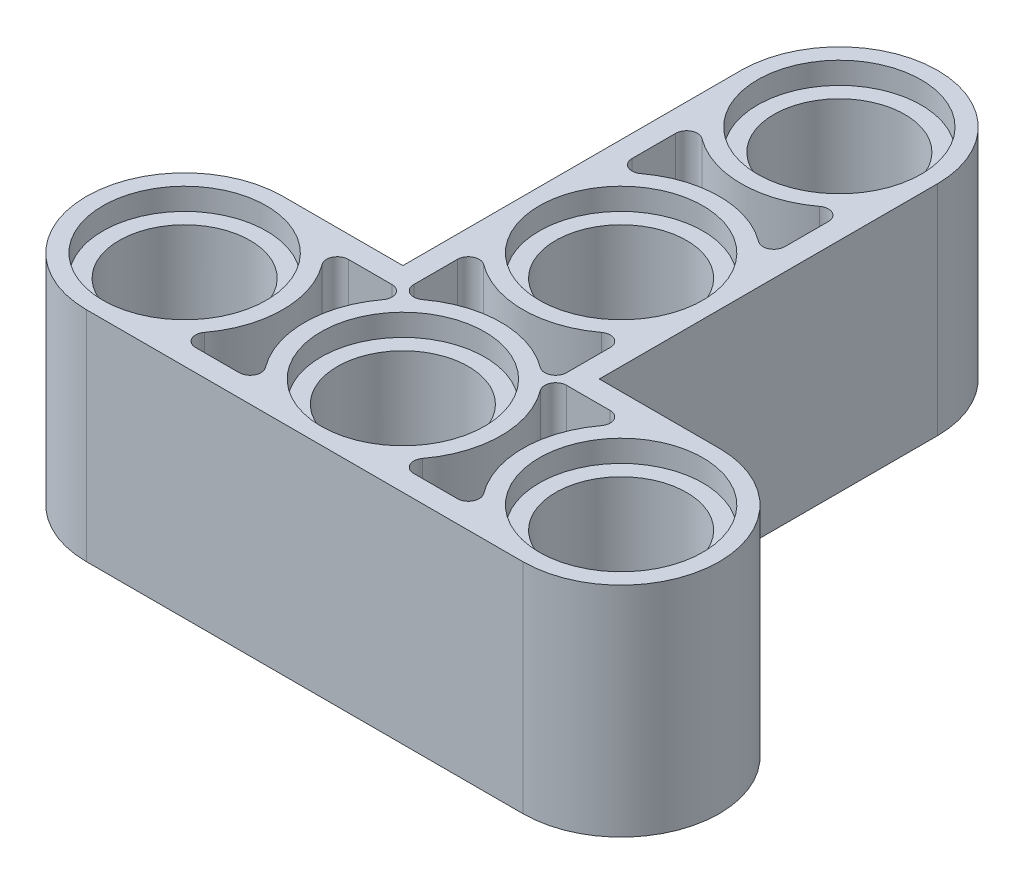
from build123d import *

# Parameters (mm, degrees)
BOSS_EXTRUDE1_DEPTH      = 4
BOSS_EXTRUDE1_DEPTH_BACK = 4
SKETCH1_R                = 2.4
SKETCH2_R                = 3
CUT_EXTRUDE1_DEPTH       = 0.8
CUT_EXTRUDE2_START       = -3.2
CUT_EXTRUDE2_DEPTH       = 3.2


with BuildPart() as part:
    # Sketch1 → Boss-Extrude1 (new, two sides: drawn at the far end of the back side and taken through both)
    with BuildSketch(Plane(origin=(0, 0, 0), x_dir=(1, 0, 0), z_dir=(0, 1, 0)).offset(-BOSS_EXTRUDE1_DEPTH_BACK)):
        with BuildLine():
            Line((8, 3.6), (3.6, 3.6))
            Line((3.6, 3.6), (3.6, 16))
            ThreePointArc((3.6, 16), (0, 19.6), (-3.6, 16))
            Line((-3.6, 16), (-3.6, 3.6))
            Line((-3.6, 3.6), (-8, 3.6))
            ThreePointArc((-8, 3.6), (-11.6, 0), (-8, -3.6))
            Line((-8, -3.6), (8, -3.6))
            ThreePointArc((8, -3.6), (11.6, 0), (8, 3.6))
        make_face()
        with Locations(Location((0, 0, 0), (0, 0, 270))):
            Circle(SKETCH1_R, mode=Mode.SUBTRACT)
        with Locations(Location((8, 0, 0), (0, 0, 270))):
            Circle(SKETCH1_R, mode=Mode.SUBTRACT)
        with Locations(Location((-8, 0, 0), (0, 0, 270))):
            Circle(SKETCH1_R, mode=Mode.SUBTRACT)
        with Locations(Location((0, 8, 0), (0, 0, 270))):
            Circle(SKETCH1_R, mode=Mode.SUBTRACT)
        with Locations(Location((0, 16, 0), (0, 0, 270))):
            Circle(SKETCH1_R, mode=Mode.SUBTRACT)
    extrude(amount=BOSS_EXTRUDE1_DEPTH + BOSS_EXTRUDE1_DEPTH_BACK)

    # Sketch2 → Cut-Extrude1 (cut)
    with BuildSketch(Plane(origin=(0, 4, 0), x_dir=(1, 0, 0), z_dir=(0, 1, 0))):
        with Locations(Location((0, 16, 0), (0, 0, 270))):
            Circle(SKETCH2_R)
        with Locations(Location((0, 8, 0), (0, 0, 270))):
            Circle(SKETCH2_R)
        with Locations(Location((0, 0, 0), (0, 0, 270))):
            Circle(SKETCH2_R)
        with Locations(Location((8, 0, 0), (0, 0, 270))):
            Circle(SKETCH2_R)
        with Locations(Location((-8, 0, 0), (0, 0, 270))):
            Circle(SKETCH2_R)
    cut_extrude1 = extrude(amount=-CUT_EXTRUDE1_DEPTH, mode=Mode.SUBTRACT)

    # Mirror1: Cut-Extrude1 across plane
    add(cut_extrude1.mirror(Plane.ZX), mode=Mode.SUBTRACT)

    # Sketch3 → Cut-Extrude2 (cut)
    with BuildSketch(Plane(origin=(0, 4, 0), x_dir=(1, 0, 0), z_dir=(0, 1, 0)).offset(CUT_EXTRUDE2_START)):
        with BuildLine():
            Line((-4.8, 2.8), (-3.2, 2.8))
            ThreePointArc((-3.2, 2.8), (-2.842229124, 2.578885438), (-2.88, 2.16))
            ThreePointArc((-2.88, 2.16), (-3.6, 0), (-2.88, -2.16))
            ThreePointArc((-2.88, -2.16), (-2.842229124, -2.578885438), (-3.2, -2.8))
            Line((-3.2, -2.8), (-4.8, -2.8))
            ThreePointArc((-4.8, -2.8), (-5.157770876, -2.578885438), (-5.12, -2.16))
            ThreePointArc((-5.12, -2.16), (-4.4, 0), (-5.12, 2.16))
            ThreePointArc((-5.12, 2.16), (-5.157770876, 2.578885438), (-4.8, 2.8))
        make_face()
        with BuildLine():
            Line((2.8, 4.8), (2.8, 3.2))
            ThreePointArc((2.8, 3.2), (2.578885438, 2.842229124), (2.16, 2.88))
            ThreePointArc((2.16, 2.88), (0, 3.6), (-2.16, 2.88))
            ThreePointArc((-2.16, 2.88), (-2.578885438, 2.842229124), (-2.8, 3.2))
            Line((-2.8, 3.2), (-2.8, 4.8))
            ThreePointArc((-2.8, 4.8), (-2.578885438, 5.157770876), (-2.16, 5.12))
            ThreePointArc((-2.16, 5.12), (0, 4.4), (2.16, 5.12))
            ThreePointArc((2.16, 5.12), (2.578885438, 5.157770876), (2.8, 4.8))
        make_face()
        with BuildLine():
            Line((4.8, -2.8), (3.2, -2.8))
            ThreePointArc((3.2, -2.8), (2.842229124, -2.578885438), (2.88, -2.16))
            ThreePointArc((2.88, -2.16), (3.6, 0), (2.88, 2.16))
            ThreePointArc((2.88, 2.16), (2.842229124, 2.578885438), (3.2, 2.8))
            Line((3.2, 2.8), (4.8, 2.8))
            ThreePointArc((4.8, 2.8), (5.157770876, 2.578885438), (5.12, 2.16))
            ThreePointArc((5.12, 2.16), (4.4, 0), (5.12, -2.16))
            ThreePointArc((5.12, -2.16), (5.157770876, -2.578885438), (4.8, -2.8))
        make_face()
        with BuildLine():
            Line((2.8, 12.8), (2.8, 11.2))
            ThreePointArc((2.8, 11.2), (2.578885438, 10.842229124), (2.16, 10.88))
            ThreePointArc((2.16, 10.88), (0, 11.6), (-2.16, 10.88))
            ThreePointArc((-2.16, 10.88), (-2.578885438, 10.842229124), (-2.8, 11.2))
            Line((-2.8, 11.2), (-2.8, 12.8))
            ThreePointArc((-2.8, 12.8), (-2.578885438, 13.157770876), (-2.16, 13.12))
            ThreePointArc((-2.16, 13.12), (0, 12.4), (2.16, 13.12))
            ThreePointArc((2.16, 13.12), (2.578885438, 13.157770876), (2.8, 12.8))
        make_face()
    cut_extrude2 = extrude(amount=CUT_EXTRUDE2_DEPTH, mode=Mode.SUBTRACT)

    # Mirror2: Cut-Extrude2 across plane
    add(cut_extrude2.mirror(Plane.ZX), mode=Mode.SUBTRACT)


solid = part.part
